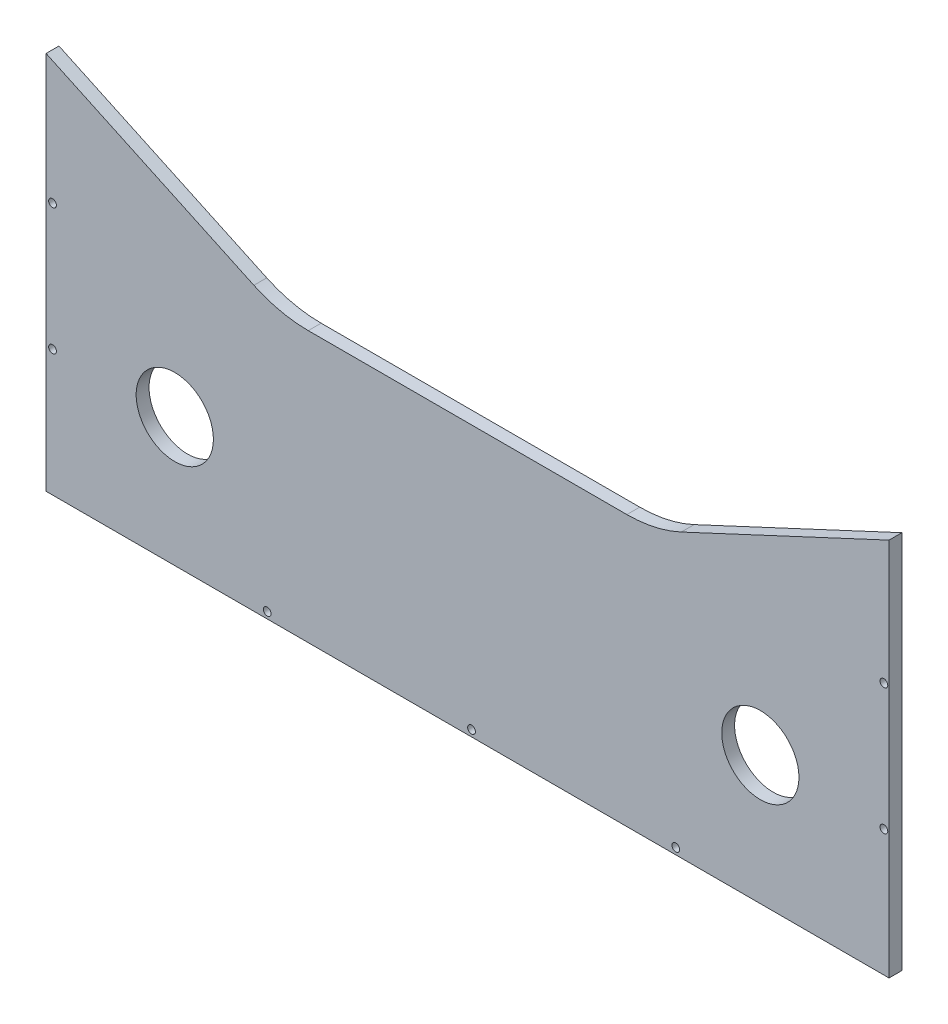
from build123d import *

# Parameters (mm, degrees)
SKETCH1_R           = 1.5
SKETCH1_R_2         = 15
BOSS_EXTRUDE1_DEPTH = 5
BOSS_EXTRUDE2_START = -5
SKETCH2_R           = 1.5
BOSS_EXTRUDE2_DEPTH = 5
SKETCH3_R           = 1.5
CUT_EXTRUDE1_DEPTH  = 5


with BuildPart() as part:
    # Sketch1 → Boss-Extrude1 (new body)
    with BuildSketch(Plane(origin=(0, 0, 0), x_dir=(-1, 0, 0), z_dir=(0, 0, -1))):
        with BuildLine():
            Line((-163.75, -52.5), (163.75, -52.5))
            Line((163.75, -52.5), (163.75, 94.83))
            Line((163.75, 94.83), (83.01920201, 57.184610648))
            ThreePointArc((83.01920201, 57.184610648), (72.71026962, 53.685199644), (61.888288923, 52.5))
            Line((61.888288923, 52.5), (-61.888288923, 52.5))
            ThreePointArc((-61.888288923, 52.5), (-72.71026962, 53.685199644), (-83.01920201, 57.184610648))
            Line((-83.01920201, 57.184610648), (-163.75, 94.83))
            Line((-163.75, 94.83), (-163.75, -52.5))
        make_face()
        with Locations(Location((161.75, -3.39, 0), (0, 0, 180))):
            Circle(SKETCH1_R, mode=Mode.SUBTRACT)
        with Locations(Location((0, -50.5, 0), (0, 0, 180))):
            Circle(SKETCH1_R, mode=Mode.SUBTRACT)
        with Locations(Location((113.75, -2.5, 0), (0, 0, 180))):
            Circle(SKETCH1_R_2, mode=Mode.SUBTRACT)
        with Locations(Location((-113.75, -2.5, 0), (0, 0, 180))):
            Circle(SKETCH1_R_2, mode=Mode.SUBTRACT)
        with Locations(Location((161.75, 45.72, 0), (0, 0, 180))):
            Circle(SKETCH1_R, mode=Mode.SUBTRACT)
        with Locations(Location((-161.75, 45.72, 0), (0, 0, 180))):
            Circle(SKETCH1_R, mode=Mode.SUBTRACT)
        with Locations(Location((-161.75, -3.39, 0), (0, 0, 180))):
            Circle(SKETCH1_R, mode=Mode.SUBTRACT)
        with Locations(Location((-81.875, -50.5, 0), (0, 0, 180))):
            Circle(SKETCH1_R, mode=Mode.SUBTRACT)
        with Locations(Location((81.875, -50.5, 0), (0, 0, 180))):
            Circle(SKETCH1_R, mode=Mode.SUBTRACT)
    extrude(amount=-BOSS_EXTRUDE1_DEPTH)

    # Sketch2 → Boss-Extrude2 (add)
    with BuildSketch(Plane.XY.offset(5).offset(BOSS_EXTRUDE2_START)):
        with Locations((-161.75, 45.72)):
            Circle(SKETCH2_R)
        with Locations((-161.75, -3.39)):
            Circle(SKETCH2_R)
        with Locations((-81.875, -50.5)):
            Circle(SKETCH2_R)
        with Locations((0, -50.5)):
            Circle(SKETCH2_R)
        with Locations((81.875, -50.5)):
            Circle(SKETCH2_R)
    extrude(amount=BOSS_EXTRUDE2_DEPTH)

    # Sketch3 → Cut-Extrude1 (cut)
    with BuildSketch(Plane.XY.offset(5)):
        with Locations((80.911830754, -50)):
            Circle(SKETCH3_R)
        with Locations((1.536830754, -50)):
            Circle(SKETCH3_R)
        with Locations((-77.838169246, -50)):
            Circle(SKETCH3_R)
        with Locations((-161.25, -3.39)):
            Circle(SKETCH3_R)
        with Locations((-161.25, 45.72)):
            Circle(SKETCH3_R)
    extrude(amount=-CUT_EXTRUDE1_DEPTH, mode=Mode.SUBTRACT)


solid = part.part
